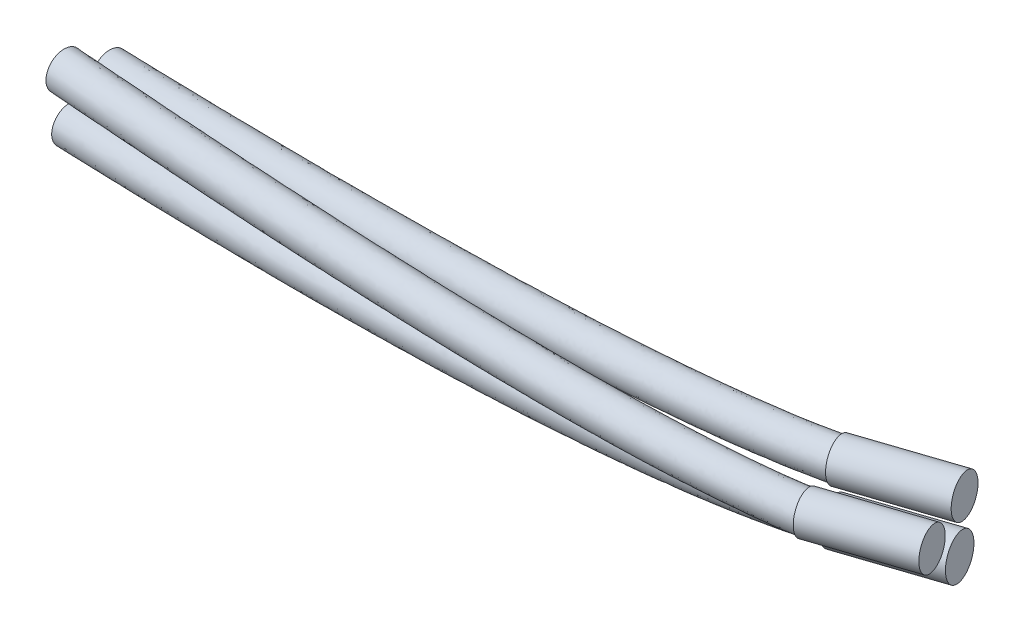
ISO-10303-21;
HEADER;
FILE_DESCRIPTION(('STEP AP214'),'2;1');
FILE_NAME('part.step','',(''),(''),'','','');
FILE_SCHEMA(('AUTOMOTIVE_DESIGN { 1 0 10303 214 1 1 1 1 }'));
ENDSEC;
DATA;
#1=APPLICATION_CONTEXT('core data for automotive mechanical design processes');
#2=APPLICATION_PROTOCOL_DEFINITION('international standard','automotive_design',2000,#1);
#3=PRODUCT_CONTEXT('',#1,'mechanical');
#4=PRODUCT('Part','Part','',(#3));
#5=PRODUCT_RELATED_PRODUCT_CATEGORY('part','',(#4));
#6=PRODUCT_DEFINITION_FORMATION('','',#4);
#7=PRODUCT_DEFINITION_CONTEXT('part definition',#1,'design');
#8=PRODUCT_DEFINITION('design','',#6,#7);
#9=PRODUCT_DEFINITION_SHAPE('','',#8);
#10=(LENGTH_UNIT() NAMED_UNIT(*) SI_UNIT(.MILLI.,.METRE.));
#11=(NAMED_UNIT(*) PLANE_ANGLE_UNIT() SI_UNIT($,.RADIAN.));
#12=(NAMED_UNIT(*) SI_UNIT($,.STERADIAN.) SOLID_ANGLE_UNIT());
#13=UNCERTAINTY_MEASURE_WITH_UNIT(LENGTH_MEASURE(1.E-05),#10,'distance_accuracy_value','');
#14=(GEOMETRIC_REPRESENTATION_CONTEXT(3) GLOBAL_UNCERTAINTY_ASSIGNED_CONTEXT((#13)) GLOBAL_UNIT_ASSIGNED_CONTEXT((#10,
#11,#12)) REPRESENTATION_CONTEXT('',''));
#15=CARTESIAN_POINT('',(0.,0.,0.));
#16=DIRECTION('',(0.,0.,1.));
#17=DIRECTION('',(1.,0.,0.));
#18=AXIS2_PLACEMENT_3D('',#15,#16,#17);
#19=CARTESIAN_POINT('',(0.,0.79440455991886,-4.12713056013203));
#20=DIRECTION('',(1.,0.,0.));
#21=DIRECTION('',(0.,0.,-1.));
#22=AXIS2_PLACEMENT_3D('',#19,#20,#21);
#23=PLANE('',#22);
#24=CARTESIAN_POINT('',(0.,0.79440455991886,-4.12713056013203));
#25=DIRECTION('',(1.,0.,0.));
#26=DIRECTION('',(0.,0.,-1.));
#27=AXIS2_PLACEMENT_3D('',#24,#25,#26);
#28=CIRCLE('',#27,1.25);
#29=CARTESIAN_POINT('',(0.,0.79440455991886,-5.37713056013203));
#30=VERTEX_POINT('',#29);
#31=EDGE_CURVE('E55',#30,#30,#28,.T.);
#32=ORIENTED_EDGE('',*,*,#31,.F.);
#33=EDGE_LOOP('',(#32));
#34=FACE_BOUND('',#33,.T.);
#35=ADVANCED_FACE('F49',(#34),#23,.F.);
#36=CARTESIAN_POINT('',(0.,0.79440455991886,-5.37713056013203));
#37=CARTESIAN_POINT('',(12.1586068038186,1.22847589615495,-4.76331330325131));
#38=CARTESIAN_POINT('',(22.3547463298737,1.64170021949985,-4.47925634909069));
#39=CARTESIAN_POINT('',(38.8251351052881,2.36417102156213,-4.58448126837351));
#40=CARTESIAN_POINT('',(45.0967821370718,2.67313323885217,-4.97976760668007));
#41=CARTESIAN_POINT('',(49.4162736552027,2.90653788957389,-5.69425629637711));
#42=CARTESIAN_POINT('',(0.,3.29440455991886,-5.37713056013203));
#43=CARTESIAN_POINT('',(12.1449671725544,3.72847589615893,-4.43634843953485));
#44=CARTESIAN_POINT('',(22.3425593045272,4.07663191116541,-3.82391721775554));
#45=CARTESIAN_POINT('',(38.9117197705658,4.548636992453,-3.32785015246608));
#46=CARTESIAN_POINT('',(45.2622776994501,4.67230034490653,-3.43518698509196));
#47=CARTESIAN_POINT('',(49.8622791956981,4.67430484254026,-3.98367772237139));
#48=CARTESIAN_POINT('',(0.,3.29440455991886,-2.87713056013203));
#49=CARTESIAN_POINT('',(12.1906932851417,3.4015110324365,-1.93634843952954));
#50=CARTESIAN_POINT('',(22.4506634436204,3.4228308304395,-1.38936216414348));
#51=CARTESIAN_POINT('',(39.191311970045,3.29068362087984,-1.15861476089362));
#52=CARTESIAN_POINT('',(45.6485339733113,3.13726860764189,-1.45770551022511));
#53=CARTESIAN_POINT('',(50.4087253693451,2.90807403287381,-2.30087490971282));
#54=CARTESIAN_POINT('',(0.,0.79440455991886,-2.87713056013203));
#55=CARTESIAN_POINT('',(12.2043329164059,0.901511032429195,-2.26331330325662));
#56=CARTESIAN_POINT('',(22.4628504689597,0.987899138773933,-2.04470129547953));
#57=CARTESIAN_POINT('',(39.1047273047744,1.10621764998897,-2.41524587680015));
#58=CARTESIAN_POINT('',(45.4830384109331,1.13810150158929,-3.00228613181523));
#59=CARTESIAN_POINT('',(49.9627198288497,1.14030707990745,-4.01145348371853));
#60=CARTESIAN_POINT('',(0.,-1.70559544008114,-2.87713056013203));
#61=CARTESIAN_POINT('',(12.2179725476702,-1.59848896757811,-2.5902781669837));
#62=CARTESIAN_POINT('',(22.4750374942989,-1.44703255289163,-2.70004042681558));
#63=CARTESIAN_POINT('',(39.0181426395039,-1.0782483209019,-3.67187699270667));
#64=CARTESIAN_POINT('',(45.3175428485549,-0.861065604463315,-4.54686675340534));
#65=CARTESIAN_POINT('',(49.5167142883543,-0.627459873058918,-5.72203205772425));
#66=CARTESIAN_POINT('',(0.,-1.70559544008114,-5.37713056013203));
#67=CARTESIAN_POINT('',(12.1722464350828,-1.27152410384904,-5.09027816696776));
#68=CARTESIAN_POINT('',(22.3669333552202,-0.793231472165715,-5.13459548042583));
#69=CARTESIAN_POINT('',(38.7385504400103,0.179705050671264,-5.84111238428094));
#70=CARTESIAN_POINT('',(44.9312865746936,0.673966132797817,-6.52434822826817));
#71=CARTESIAN_POINT('',(48.9702681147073,1.13877093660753,-7.40483487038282));
#72=CARTESIAN_POINT('',(0.,0.79440455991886,-5.37713056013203));
#73=CARTESIAN_POINT('',(12.1586068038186,1.22847589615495,-4.76331330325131));
#74=CARTESIAN_POINT('',(22.3547463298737,1.64170021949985,-4.47925634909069));
#75=CARTESIAN_POINT('',(38.8251351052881,2.36417102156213,-4.58448126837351));
#76=CARTESIAN_POINT('',(45.0967821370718,2.67313323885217,-4.97976760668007));
#77=CARTESIAN_POINT('',(49.4162736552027,2.90653788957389,-5.69425629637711));
#78=(BOUNDED_SURFACE() B_SPLINE_SURFACE(3,3,((#36,#37,#38,#39,#40,#41),(#42,#43,#44,#45,#46,
#47),(#48,#49,#50,#51,#52,#53),(#54,#55,#56,#57,#58,#59),(#60,#61,#62,#63,#64,#65),(#66,#67,#68,
#69,#70,#71),(#72,#73,#74,#75,#76,#77)),.UNSPECIFIED.,.T.,.F.,
.F.) B_SPLINE_SURFACE_WITH_KNOTS((4,3,4),(4,2,4),(0.,0.5,1.),(0.,0.5,1.),
.UNSPECIFIED.) GEOMETRIC_REPRESENTATION_ITEM() RATIONAL_B_SPLINE_SURFACE(((1.,1.,1.,1.,1.,1.),
(0.333333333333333,0.333333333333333,0.333333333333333,0.333333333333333,0.333333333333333,
0.333333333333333),(0.333333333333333,0.333333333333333,0.333333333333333,0.333333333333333,
0.333333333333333,0.333333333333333),(1.,1.,1.,1.,1.,1.),(0.333333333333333,0.333333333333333,
0.333333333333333,0.333333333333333,0.333333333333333,0.333333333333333),(0.333333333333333,
0.333333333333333,0.333333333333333,0.333333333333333,0.333333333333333,0.333333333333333),(1.,
1.,1.,1.,1.,1.))) REPRESENTATION_ITEM('') SURFACE());
#79=CARTESIAN_POINT('',(49.6894967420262,2.02342248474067,-4.85285489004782));
#80=DIRECTION('',(0.959372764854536,0.0294719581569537,-0.280598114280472));
#81=DIRECTION('',(-0.218578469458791,0.706492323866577,-0.673121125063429));
#82=AXIS2_PLACEMENT_3D('',#79,#80,#81);
#83=CIRCLE('',#82,1.25);
#84=CARTESIAN_POINT('',(49.4162736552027,2.90653788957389,-5.69425629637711));
#85=VERTEX_POINT('',#84);
#86=EDGE_CURVE('E12',#85,#85,#83,.T.);
#87=ORIENTED_EDGE('',*,*,#86,.F.);
#88=EDGE_LOOP('',(#87));
#89=FACE_BOUND('',#88,.T.);
#90=ORIENTED_EDGE('',*,*,#31,.T.);
#91=EDGE_LOOP('',(#90));
#92=FACE_BOUND('',#91,.T.);
#93=ADVANCED_FACE('F81',(#89,#92),#78,.T.);
#94=CARTESIAN_POINT('',(56.4051060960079,2.22972619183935,-6.81704169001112));
#95=DIRECTION('',(-0.959372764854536,-0.0294719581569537,0.280598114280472));
#96=DIRECTION('',(0.280720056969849,0.,0.959789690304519));
#97=AXIS2_PLACEMENT_3D('',#94,#95,#96);
#98=CYLINDRICAL_SURFACE('',#97,1.36398686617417);
#99=CARTESIAN_POINT('',(56.4051060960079,2.22972619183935,-6.81704169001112));
#100=DIRECTION('',(0.959372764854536,0.0294719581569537,-0.280598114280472));
#101=DIRECTION('',(-0.280720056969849,0.,-0.959789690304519));
#102=AXIS2_PLACEMENT_3D('',#99,#100,#101);
#103=CIRCLE('',#102,1.36398686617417);
#104=CARTESIAN_POINT('',(56.0222076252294,2.22972619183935,-8.12618222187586));
#105=VERTEX_POINT('',#104);
#106=EDGE_CURVE('E60',#105,#105,#103,.T.);
#107=ORIENTED_EDGE('',*,*,#106,.F.);
#108=EDGE_LOOP('',(#107));
#109=FACE_BOUND('',#108,.T.);
#110=CARTESIAN_POINT('',(49.6894967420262,2.02342248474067,-4.85285489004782));
#111=DIRECTION('',(0.959372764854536,0.0294719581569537,-0.280598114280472));
#112=DIRECTION('',(-0.280720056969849,0.,-0.959789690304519));
#113=AXIS2_PLACEMENT_3D('',#110,#111,#112);
#114=CIRCLE('',#113,1.36398686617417);
#115=CARTESIAN_POINT('',(49.3065982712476,2.02342248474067,-6.16199542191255));
#116=VERTEX_POINT('',#115);
#117=EDGE_CURVE('E62',#116,#116,#114,.T.);
#118=ORIENTED_EDGE('',*,*,#117,.T.);
#119=EDGE_LOOP('',(#118));
#120=FACE_BOUND('',#119,.T.);
#121=ADVANCED_FACE('F68',(#109,#120),#98,.T.);
#122=CARTESIAN_POINT('',(56.4051060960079,2.22972619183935,-6.81704169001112));
#123=DIRECTION('',(0.959372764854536,0.0294719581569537,-0.280598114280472));
#124=DIRECTION('',(-0.280720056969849,0.,-0.959789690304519));
#125=AXIS2_PLACEMENT_3D('',#122,#123,#124);
#126=PLANE('',#125);
#127=ORIENTED_EDGE('',*,*,#106,.T.);
#128=EDGE_LOOP('',(#127));
#129=FACE_BOUND('',#128,.T.);
#130=ADVANCED_FACE('F72',(#129),#126,.T.);
#131=CARTESIAN_POINT('',(49.6894967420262,2.02342248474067,-4.85285489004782));
#132=DIRECTION('',(0.959372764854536,0.0294719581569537,-0.280598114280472));
#133=DIRECTION('',(-0.280720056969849,0.,-0.959789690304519));
#134=AXIS2_PLACEMENT_3D('',#131,#132,#133);
#135=PLANE('',#134);
#136=ORIENTED_EDGE('',*,*,#86,.T.);
#137=EDGE_LOOP('',(#136));
#138=FACE_BOUND('',#137,.T.);
#139=ORIENTED_EDGE('',*,*,#117,.F.);
#140=EDGE_LOOP('',(#139));
#141=FACE_BOUND('',#140,.T.);
#142=ADVANCED_FACE('F70',(#138,#141),#135,.F.);
#143=CLOSED_SHELL('',(#35,#93,#121,#130,#142));
#144=MANIFOLD_SOLID_BREP('B2',#143);
#145=CARTESIAN_POINT('',(0.,-0.999081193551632,-1.38419264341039));
#146=DIRECTION('',(1.,0.,0.));
#147=DIRECTION('',(0.,0.,-1.));
#148=AXIS2_PLACEMENT_3D('',#145,#146,#147);
#149=PLANE('',#148);
#150=CARTESIAN_POINT('',(0.,-0.999081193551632,-1.38419264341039));
#151=DIRECTION('',(1.,0.,0.));
#152=DIRECTION('',(0.,0.,-1.));
#153=AXIS2_PLACEMENT_3D('',#150,#151,#152);
#154=CIRCLE('',#153,1.25);
#155=CARTESIAN_POINT('',(0.,-0.999081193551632,-2.63419264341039));
#156=VERTEX_POINT('',#155);
#157=EDGE_CURVE('E143',#156,#156,#154,.T.);
#158=ORIENTED_EDGE('',*,*,#157,.F.);
#159=EDGE_LOOP('',(#158));
#160=FACE_BOUND('',#159,.T.);
#161=ADVANCED_FACE('F137',(#160),#149,.F.);
#162=CARTESIAN_POINT('',(0.,-0.999081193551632,-2.63419264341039));
#163=CARTESIAN_POINT('',(12.2185613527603,-0.923747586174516,-2.25493811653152));
#164=CARTESIAN_POINT('',(22.4820984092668,-0.822440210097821,-2.27825956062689));
#165=CARTESIAN_POINT('',(39.0697813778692,-0.583147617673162,-3.10595006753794));
#166=CARTESIAN_POINT('',(45.4018473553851,-0.445256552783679,-3.91819737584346));
#167=CARTESIAN_POINT('',(49.6958589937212,-0.299512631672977,-5.07508616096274));
#168=CARTESIAN_POINT('',(0.,1.50091880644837,-2.63419264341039));
#169=CARTESIAN_POINT('',(12.204921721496,1.57625241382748,-1.92797325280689));
#170=CARTESIAN_POINT('',(22.4699113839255,1.61249148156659,-1.62292042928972));
#171=CARTESIAN_POINT('',(39.1563660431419,1.60131835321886,-1.84931895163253));
#172=CARTESIAN_POINT('',(45.567342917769,1.55391055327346,-2.3736167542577));
#173=CARTESIAN_POINT('',(50.1418645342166,1.46825432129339,-3.36450758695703));
#174=CARTESIAN_POINT('',(0.,1.50091880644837,-0.134192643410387));
#175=CARTESIAN_POINT('',(12.2506478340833,1.24928755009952,0.572026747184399));
#176=CARTESIAN_POINT('',(22.5780155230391,0.958690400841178,0.811634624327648));
#177=CARTESIAN_POINT('',(39.4359582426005,0.343364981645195,0.319916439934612));
#178=CARTESIAN_POINT('',(45.9535991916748,0.0188788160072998,-0.396135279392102));
#179=CARTESIAN_POINT('',(50.6883107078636,-0.297976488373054,-1.68170477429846));
#180=CARTESIAN_POINT('',(0.,-0.999081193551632,-0.134192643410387));
#181=CARTESIAN_POINT('',(12.2642874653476,-1.25071244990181,0.245061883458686));
#182=CARTESIAN_POINT('',(22.5902025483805,-1.47624129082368,0.156295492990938));
#183=CARTESIAN_POINT('',(39.3493735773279,-1.84110098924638,-0.936714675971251));
#184=CARTESIAN_POINT('',(45.7881036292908,-1.98028829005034,-1.94071590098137));
#185=CARTESIAN_POINT('',(50.2423051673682,-2.06574344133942,-3.39228334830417));
#186=CARTESIAN_POINT('',(0.,-3.49908119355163,-0.134192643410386));
#187=CARTESIAN_POINT('',(12.2779270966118,-3.75071244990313,-0.0819029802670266));
#188=CARTESIAN_POINT('',(22.6023895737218,-3.91117298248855,-0.499043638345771));
#189=CARTESIAN_POINT('',(39.2627889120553,-4.02556696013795,-2.19334579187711));
#190=CARTESIAN_POINT('',(45.6226080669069,-3.97945539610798,-3.48529652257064));
#191=CARTESIAN_POINT('',(49.7962996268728,-3.83351039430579,-5.10286192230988));
#192=CARTESIAN_POINT('',(0.,-3.49908119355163,-2.63419264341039));
#193=CARTESIAN_POINT('',(12.2322009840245,-3.42374758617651,-2.58190298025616));
#194=CARTESIAN_POINT('',(22.4942854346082,-3.25737190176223,-2.93359869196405));
#195=CARTESIAN_POINT('',(38.9831967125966,-2.76761358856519,-4.36258118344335));
#196=CARTESIAN_POINT('',(45.2363517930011,-2.44442365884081,-5.46277799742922));
#197=CARTESIAN_POINT('',(49.2498534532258,-2.06727958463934,-6.78566473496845));
#198=CARTESIAN_POINT('',(0.,-0.999081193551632,-2.63419264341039));
#199=CARTESIAN_POINT('',(12.2185613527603,-0.923747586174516,-2.25493811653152));
#200=CARTESIAN_POINT('',(22.4820984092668,-0.822440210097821,-2.27825956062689));
#201=CARTESIAN_POINT('',(39.0697813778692,-0.583147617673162,-3.10595006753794));
#202=CARTESIAN_POINT('',(45.4018473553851,-0.445256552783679,-3.91819737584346));
#203=CARTESIAN_POINT('',(49.6958589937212,-0.299512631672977,-5.07508616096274));
#204=(BOUNDED_SURFACE() B_SPLINE_SURFACE(3,3,((#162,#163,#164,#165,#166,#167),(#168,#169,#170,
#171,#172,#173),(#174,#175,#176,#177,#178,#179),(#180,#181,#182,#183,#184,#185),(#186,#187,#188,
#189,#190,#191),(#192,#193,#194,#195,#196,#197),(#198,#199,#200,#201,#202,#203)),.UNSPECIFIED.,
.T.,.F.,.F.) B_SPLINE_SURFACE_WITH_KNOTS((4,3,4),(4,2,4),(0.,0.5,1.),(0.,0.5,1.),
.UNSPECIFIED.) GEOMETRIC_REPRESENTATION_ITEM() RATIONAL_B_SPLINE_SURFACE(((1.,1.,1.,1.,1.,1.),
(0.333333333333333,0.333333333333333,0.333333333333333,0.333333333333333,0.333333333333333,
0.333333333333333),(0.333333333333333,0.333333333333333,0.333333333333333,0.333333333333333,
0.333333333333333,0.333333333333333),(1.,1.,1.,1.,1.,1.),(0.333333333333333,0.333333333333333,
0.333333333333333,0.333333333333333,0.333333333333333,0.333333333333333),(0.333333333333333,
0.333333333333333,0.333333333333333,0.333333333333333,0.333333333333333,0.333333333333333),(1.,
1.,1.,1.,1.,1.))) REPRESENTATION_ITEM('') SURFACE());
#205=CARTESIAN_POINT('',(49.9690820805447,-1.1826280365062,-4.23368475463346));
#206=DIRECTION('',(0.959372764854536,0.0294719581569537,-0.280598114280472));
#207=DIRECTION('',(-0.218578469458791,0.706492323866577,-0.673121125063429));
#208=AXIS2_PLACEMENT_3D('',#205,#206,#207);
#209=CIRCLE('',#208,1.25);
#210=CARTESIAN_POINT('',(49.6958589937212,-0.299512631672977,-5.07508616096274));
#211=VERTEX_POINT('',#210);
#212=EDGE_CURVE('E47',#211,#211,#209,.T.);
#213=ORIENTED_EDGE('',*,*,#212,.F.);
#214=EDGE_LOOP('',(#213));
#215=FACE_BOUND('',#214,.T.);
#216=ORIENTED_EDGE('',*,*,#157,.T.);
#217=EDGE_LOOP('',(#216));
#218=FACE_BOUND('',#217,.T.);
#219=ADVANCED_FACE('F169',(#215,#218),#204,.T.);
#220=CARTESIAN_POINT('',(56.6846914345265,-0.976324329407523,-6.19787155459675));
#221=DIRECTION('',(-0.959372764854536,-0.0294719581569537,0.280598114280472));
#222=DIRECTION('',(0.280720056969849,0.,0.959789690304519));
#223=AXIS2_PLACEMENT_3D('',#220,#221,#222);
#224=CYLINDRICAL_SURFACE('',#223,1.44661881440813);
#225=CARTESIAN_POINT('',(56.6846914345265,-0.976324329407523,-6.19787155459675));
#226=DIRECTION('',(0.959372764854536,0.0294719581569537,-0.280598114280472));
#227=DIRECTION('',(-0.280720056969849,0.,-0.959789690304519));
#228=AXIS2_PLACEMENT_3D('',#225,#226,#227);
#229=CIRCLE('',#228,1.44661881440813);
#230=CARTESIAN_POINT('',(56.2785965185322,-0.976324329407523,-7.58632137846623));
#231=VERTEX_POINT('',#230);
#232=EDGE_CURVE('E148',#231,#231,#229,.T.);
#233=ORIENTED_EDGE('',*,*,#232,.F.);
#234=EDGE_LOOP('',(#233));
#235=FACE_BOUND('',#234,.T.);
#236=CARTESIAN_POINT('',(49.9690820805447,-1.1826280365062,-4.23368475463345));
#237=DIRECTION('',(0.959372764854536,0.0294719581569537,-0.280598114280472));
#238=DIRECTION('',(-0.280720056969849,0.,-0.959789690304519));
#239=AXIS2_PLACEMENT_3D('',#236,#237,#238);
#240=CIRCLE('',#239,1.44661881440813);
#241=CARTESIAN_POINT('',(49.5629871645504,-1.1826280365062,-5.62213457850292));
#242=VERTEX_POINT('',#241);
#243=EDGE_CURVE('E150',#242,#242,#240,.T.);
#244=ORIENTED_EDGE('',*,*,#243,.T.);
#245=EDGE_LOOP('',(#244));
#246=FACE_BOUND('',#245,.T.);
#247=ADVANCED_FACE('F156',(#235,#246),#224,.T.);
#248=CARTESIAN_POINT('',(56.6846914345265,-0.976324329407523,-6.19787155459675));
#249=DIRECTION('',(0.959372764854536,0.0294719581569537,-0.280598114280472));
#250=DIRECTION('',(-0.280720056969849,0.,-0.959789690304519));
#251=AXIS2_PLACEMENT_3D('',#248,#249,#250);
#252=PLANE('',#251);
#253=ORIENTED_EDGE('',*,*,#232,.T.);
#254=EDGE_LOOP('',(#253));
#255=FACE_BOUND('',#254,.T.);
#256=ADVANCED_FACE('F160',(#255),#252,.T.);
#257=CARTESIAN_POINT('',(49.9690820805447,-1.1826280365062,-4.23368475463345));
#258=DIRECTION('',(0.959372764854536,0.0294719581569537,-0.280598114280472));
#259=DIRECTION('',(-0.280720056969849,0.,-0.959789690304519));
#260=AXIS2_PLACEMENT_3D('',#257,#258,#259);
#261=PLANE('',#260);
#262=ORIENTED_EDGE('',*,*,#212,.T.);
#263=EDGE_LOOP('',(#262));
#264=FACE_BOUND('',#263,.T.);
#265=ORIENTED_EDGE('',*,*,#243,.F.);
#266=EDGE_LOOP('',(#265));
#267=FACE_BOUND('',#266,.T.);
#268=ADVANCED_FACE('F158',(#264,#267),#261,.F.);
#269=CLOSED_SHELL('',(#161,#219,#247,#256,#268));
#270=MANIFOLD_SOLID_BREP('B6',#269);
#271=CARTESIAN_POINT('',(0.,2.42242499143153,-0.990567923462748));
#272=DIRECTION('',(1.,0.,0.));
#273=DIRECTION('',(0.,0.,-1.));
#274=AXIS2_PLACEMENT_3D('',#271,#272,#273);
#275=PLANE('',#274);
#276=CARTESIAN_POINT('',(0.,2.42242499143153,-0.990567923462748));
#277=DIRECTION('',(1.,0.,0.));
#278=DIRECTION('',(0.,0.,-1.));
#279=AXIS2_PLACEMENT_3D('',#276,#277,#278);
#280=CIRCLE('',#279,1.25);
#281=CARTESIAN_POINT('',(0.,2.42242499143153,-2.24056792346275));
#282=VERTEX_POINT('',#281);
#283=EDGE_CURVE('E220',#282,#282,#280,.T.);
#284=ORIENTED_EDGE('',*,*,#283,.F.);
#285=EDGE_LOOP('',(#284));
#286=FACE_BOUND('',#285,.T.);
#287=ADVANCED_FACE('F214',(#286),#275,.F.);
#288=CARTESIAN_POINT('',(0.,2.42242499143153,-2.24056792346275));
#289=CARTESIAN_POINT('',(12.2070936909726,2.44627801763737,-1.41382847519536));
#290=CARTESIAN_POINT('',(22.4824402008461,2.40707242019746,-0.998040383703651));
#291=CARTESIAN_POINT('',(35.0448373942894,2.25810807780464,-1.03294190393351));
#292=CARTESIAN_POINT('',(38.7573853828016,2.19357848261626,-1.15423003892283));
#293=CARTESIAN_POINT('',(45.2560705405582,2.03724317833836,-1.62913696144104));
#294=CARTESIAN_POINT('',(48.0407310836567,1.94544133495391,-1.98097662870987));
#295=CARTESIAN_POINT('',(50.3923011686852,1.84176475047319,-2.46902697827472));
#296=CARTESIAN_POINT('',(0.,4.92242499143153,-2.24056792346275));
#297=CARTESIAN_POINT('',(12.1934540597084,4.94627801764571,-1.08686361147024));
#298=CARTESIAN_POINT('',(22.4702531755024,4.84200411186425,-0.342701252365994));
#299=CARTESIAN_POINT('',(35.1067291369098,4.50519047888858,0.0733662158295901));
#300=CARTESIAN_POINT('',(38.8561509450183,4.36315748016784,0.0955933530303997));
#301=CARTESIAN_POINT('',(45.4775280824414,4.0250122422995,-0.119628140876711));
#302=CARTESIAN_POINT('',(48.3464816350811,3.82890836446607,-0.353397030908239));
#303=CARTESIAN_POINT('',(50.8383067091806,3.60953170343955,-0.758448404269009));
#304=CARTESIAN_POINT('',(0.,4.92242499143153,0.259432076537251));
#305=CARTESIAN_POINT('',(12.2391801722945,4.61931315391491,1.4131363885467));
#306=CARTESIAN_POINT('',(22.5783573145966,4.18820303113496,2.0918538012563));
#307=CARTESIAN_POINT('',(35.343449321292,3.39827518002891,2.30893152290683));
#308=CARTESIAN_POINT('',(39.1416591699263,3.11136951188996,2.24817359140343));
#309=CARTESIAN_POINT('',(45.8778600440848,2.50136292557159,1.82981199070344));
#310=CARTESIAN_POINT('',(48.8128328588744,2.17827709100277,1.47674511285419));
#311=CARTESIAN_POINT('',(51.3847528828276,1.84330089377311,0.924354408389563));
#312=CARTESIAN_POINT('',(0.,2.42242499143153,0.259432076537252));
#313=CARTESIAN_POINT('',(12.2528198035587,2.11931315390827,1.08617152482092));
#314=CARTESIAN_POINT('',(22.5905443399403,1.7532713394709,1.43651466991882));
#315=CARTESIAN_POINT('',(35.2815575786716,1.15119277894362,1.20262340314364));
#316=CARTESIAN_POINT('',(39.0428936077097,0.941790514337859,0.998350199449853));
#317=CARTESIAN_POINT('',(45.6564025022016,0.513593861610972,0.320303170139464));
#318=CARTESIAN_POINT('',(48.507082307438,0.294810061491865,-0.150834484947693));
#319=CARTESIAN_POINT('',(50.9387473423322,0.0755339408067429,-0.78622416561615));
#320=CARTESIAN_POINT('',(0.,-0.0775750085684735,0.259432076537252));
#321=CARTESIAN_POINT('',(12.2664594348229,-0.380686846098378,0.759206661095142));
#322=CARTESIAN_POINT('',(22.6027313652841,-0.68166035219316,0.78117553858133));
#323=CARTESIAN_POINT('',(35.2196658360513,-1.09588962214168,0.0963152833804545));
#324=CARTESIAN_POINT('',(38.944128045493,-1.22778848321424,-0.251473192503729));
#325=CARTESIAN_POINT('',(45.4349449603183,-1.47417520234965,-1.18920565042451));
#326=CARTESIAN_POINT('',(48.2013317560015,-1.58865696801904,-1.77841408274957));
#327=CARTESIAN_POINT('',(50.4927418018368,-1.69223301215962,-2.49680273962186));
#328=CARTESIAN_POINT('',(0.,-0.0775750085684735,-2.24056792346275));
#329=CARTESIAN_POINT('',(12.2207333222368,-0.0537219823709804,-1.74079333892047));
#330=CARTESIAN_POINT('',(22.4946272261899,-0.0278592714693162,-1.65337951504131));
#331=CARTESIAN_POINT('',(34.9829456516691,0.0110256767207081,-2.13925002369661));
#332=CARTESIAN_POINT('',(38.658619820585,0.0239994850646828,-2.40405343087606));
#333=CARTESIAN_POINT('',(45.034612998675,0.0494741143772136,-3.13864578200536));
#334=CARTESIAN_POINT('',(47.7349805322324,0.0619743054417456,-3.60855622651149));
#335=CARTESIAN_POINT('',(49.9462956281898,0.0739977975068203,-4.17960555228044));
#336=CARTESIAN_POINT('',(0.,2.42242499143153,-2.24056792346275));
#337=CARTESIAN_POINT('',(12.2070936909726,2.44627801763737,-1.41382847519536));
#338=CARTESIAN_POINT('',(22.4824402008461,2.40707242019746,-0.998040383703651));
#339=CARTESIAN_POINT('',(35.0448373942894,2.25810807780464,-1.03294190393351));
#340=CARTESIAN_POINT('',(38.7573853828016,2.19357848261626,-1.15423003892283));
#341=CARTESIAN_POINT('',(45.2560705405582,2.03724317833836,-1.62913696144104));
#342=CARTESIAN_POINT('',(48.0407310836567,1.94544133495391,-1.98097662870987));
#343=CARTESIAN_POINT('',(50.3923011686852,1.84176475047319,-2.46902697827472));
#344=(BOUNDED_SURFACE() B_SPLINE_SURFACE(3,3,((#288,#289,#290,#291,#292,#293,#294,#295),(#296,
#297,#298,#299,#300,#301,#302,#303),(#304,#305,#306,#307,#308,#309,#310,#311),(#312,#313,#314,
#315,#316,#317,#318,#319),(#320,#321,#322,#323,#324,#325,#326,#327),(#328,#329,#330,#331,#332,
#333,#334,#335),(#336,#337,#338,#339,#340,#341,#342,#343)),.UNSPECIFIED.,.T.,.F.,
.F.) B_SPLINE_SURFACE_WITH_KNOTS((4,3,4),(4,2,2,4),(0.,0.5,1.),(0.,0.5,0.75,1.),
.UNSPECIFIED.) GEOMETRIC_REPRESENTATION_ITEM() RATIONAL_B_SPLINE_SURFACE(((1.,1.,1.,1.,1.,1.,1.,
1.),(0.333333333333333,0.333333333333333,0.333333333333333,0.333333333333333,0.333333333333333,
0.333333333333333,0.333333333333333,0.333333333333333),(0.333333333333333,0.333333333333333,
0.333333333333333,0.333333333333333,0.333333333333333,0.333333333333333,0.333333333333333,
0.333333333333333),(1.,1.,1.,1.,1.,1.,1.,1.),(0.333333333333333,0.333333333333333,
0.333333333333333,0.333333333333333,0.333333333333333,0.333333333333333,0.333333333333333,
0.333333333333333),(0.333333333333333,0.333333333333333,0.333333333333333,0.333333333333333,
0.333333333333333,0.333333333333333,0.333333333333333,0.333333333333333),(1.,1.,1.,1.,1.,1.,1.,1.))) REPRESENTATION_ITEM('') SURFACE());
#345=CARTESIAN_POINT('',(50.6655242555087,0.958649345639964,-1.62762557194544));
#346=DIRECTION('',(0.959372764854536,0.0294719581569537,-0.280598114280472));
#347=DIRECTION('',(-0.218578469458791,0.706492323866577,-0.673121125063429));
#348=AXIS2_PLACEMENT_3D('',#345,#346,#347);
#349=CIRCLE('',#348,1.25);
#350=CARTESIAN_POINT('',(50.3923011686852,1.84176475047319,-2.46902697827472));
#351=VERTEX_POINT('',#350);
#352=EDGE_CURVE('E135',#351,#351,#349,.T.);
#353=ORIENTED_EDGE('',*,*,#352,.F.);
#354=EDGE_LOOP('',(#353));
#355=FACE_BOUND('',#354,.T.);
#356=ORIENTED_EDGE('',*,*,#283,.T.);
#357=EDGE_LOOP('',(#356));
#358=FACE_BOUND('',#357,.T.);
#359=ADVANCED_FACE('F246',(#355,#358),#344,.T.);
#360=CARTESIAN_POINT('',(57.3811336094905,1.16495305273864,-3.59181237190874));
#361=DIRECTION('',(-0.959372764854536,-0.0294719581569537,0.280598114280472));
#362=DIRECTION('',(0.280720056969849,0.,0.959789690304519));
#363=AXIS2_PLACEMENT_3D('',#360,#361,#362);
#364=CYLINDRICAL_SURFACE('',#363,1.3410723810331);
#365=CARTESIAN_POINT('',(57.3811336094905,1.16495305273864,-3.59181237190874));
#366=DIRECTION('',(0.959372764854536,0.0294719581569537,-0.280598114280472));
#367=DIRECTION('',(-0.280720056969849,0.,-0.959789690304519));
#368=AXIS2_PLACEMENT_3D('',#365,#366,#367);
#369=CIRCLE('',#368,1.3410723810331);
#370=CARTESIAN_POINT('',(57.0046676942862,1.16495305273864,-4.87895981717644));
#371=VERTEX_POINT('',#370);
#372=EDGE_CURVE('E225',#371,#371,#369,.T.);
#373=ORIENTED_EDGE('',*,*,#372,.F.);
#374=EDGE_LOOP('',(#373));
#375=FACE_BOUND('',#374,.T.);
#376=CARTESIAN_POINT('',(50.6655242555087,0.958649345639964,-1.62762557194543));
#377=DIRECTION('',(0.959372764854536,0.0294719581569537,-0.280598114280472));
#378=DIRECTION('',(-0.280720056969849,0.,-0.959789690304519));
#379=AXIS2_PLACEMENT_3D('',#376,#377,#378);
#380=CIRCLE('',#379,1.3410723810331);
#381=CARTESIAN_POINT('',(50.2890583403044,0.958649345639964,-2.91477301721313));
#382=VERTEX_POINT('',#381);
#383=EDGE_CURVE('E227',#382,#382,#380,.T.);
#384=ORIENTED_EDGE('',*,*,#383,.T.);
#385=EDGE_LOOP('',(#384));
#386=FACE_BOUND('',#385,.T.);
#387=ADVANCED_FACE('F233',(#375,#386),#364,.T.);
#388=CARTESIAN_POINT('',(57.3811336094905,1.16495305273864,-3.59181237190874));
#389=DIRECTION('',(0.959372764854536,0.0294719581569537,-0.280598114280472));
#390=DIRECTION('',(-0.280720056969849,0.,-0.959789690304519));
#391=AXIS2_PLACEMENT_3D('',#388,#389,#390);
#392=PLANE('',#391);
#393=ORIENTED_EDGE('',*,*,#372,.T.);
#394=EDGE_LOOP('',(#393));
#395=FACE_BOUND('',#394,.T.);
#396=ADVANCED_FACE('F237',(#395),#392,.T.);
#397=CARTESIAN_POINT('',(50.6655242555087,0.958649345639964,-1.62762557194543));
#398=DIRECTION('',(0.959372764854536,0.0294719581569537,-0.280598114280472));
#399=DIRECTION('',(-0.280720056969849,0.,-0.959789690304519));
#400=AXIS2_PLACEMENT_3D('',#397,#398,#399);
#401=PLANE('',#400);
#402=ORIENTED_EDGE('',*,*,#352,.T.);
#403=EDGE_LOOP('',(#402));
#404=FACE_BOUND('',#403,.T.);
#405=ORIENTED_EDGE('',*,*,#383,.F.);
#406=EDGE_LOOP('',(#405));
#407=FACE_BOUND('',#406,.T.);
#408=ADVANCED_FACE('F235',(#404,#407),#401,.F.);
#409=CLOSED_SHELL('',(#287,#359,#387,#396,#408));
#410=MANIFOLD_SOLID_BREP('B41',#409);
#411=ADVANCED_BREP_SHAPE_REPRESENTATION('',(#18,#144,#270,#410),#14);
#412=SHAPE_DEFINITION_REPRESENTATION(#9,#411);
ENDSEC;
END-ISO-10303-21;
